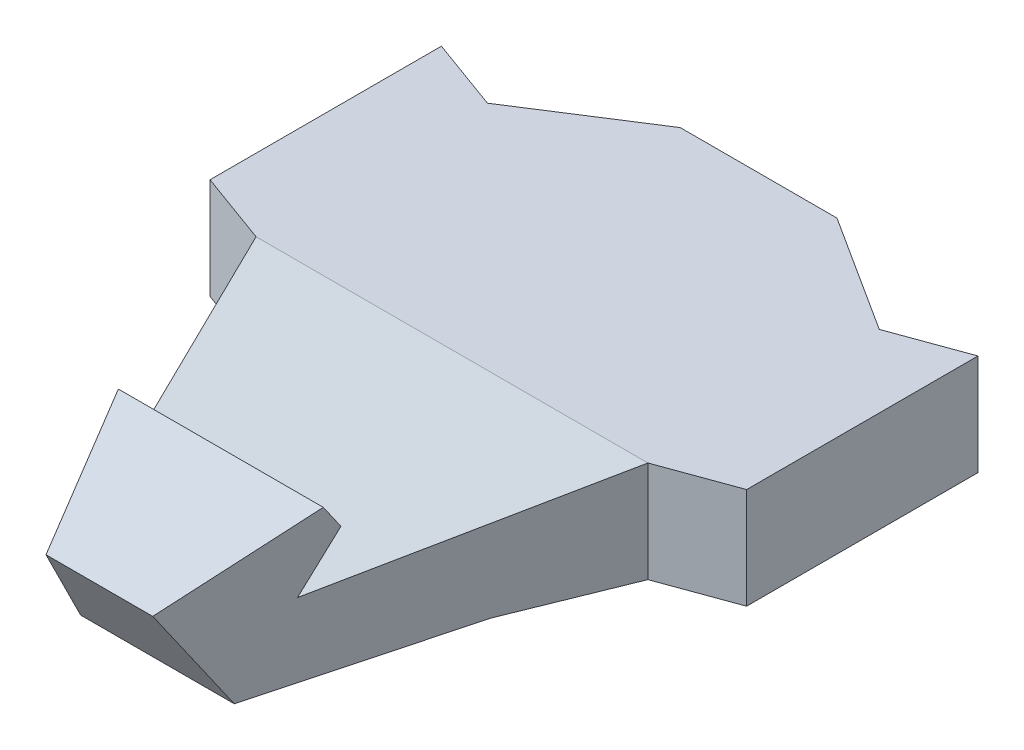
from build123d import *

# Parameters (mm, degrees)
BOSS_EXTRU_1_DEPTH           = 350
ENL_V_MAT_EXTRU_2_DEPTH      = 656.667598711
ENL_V_MAT_EXTRU_2_DEPTH_BACK = 350
ESQUISSE2_W                  = 784.427743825
ESQUISSE2_H                  = 526.453738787


with BuildPart() as part:
    # Esquisse1 → Boss.-Extru.1 (new body)
    with BuildSketch(Plane(origin=(0, 0, 0), x_dir=(1, 0, 0), z_dir=(0, 1, 0))):
        Polygon((226.103190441, 430), (123.896809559, 430), (47.210181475, 380.911501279), (0, 398.09460209), (0, 247.183100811), (47.210181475, 230), (140.193619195, 0), (209.806380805, 0), (302.789818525, 230), (350, 247.183100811), (350, 398.09460209), (302.789818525, 380.911501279), align=None)
    extrude(amount=BOSS_EXTRU_1_DEPTH)

    # Esquisse2 → Enl_v. mat.-Extru.2 (cut, two sides: drawn at the far end of the back side and taken through both)
    with BuildSketch(Plane(origin=(0, 0, 0), x_dir=(0, 0, -1), z_dir=(1, 0, 0)).offset(-ENL_V_MAT_EXTRU_2_DEPTH_BACK)):
        with Locations((249.397567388, 164.460448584)):
            Rectangle(ESQUISSE2_W, ESQUISSE2_H)
        Polygon((37.891584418, 0), (0, 60.70391631), (79.216518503, 98.684774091), (87.420569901, 85.541537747), (67.242094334, 51.299276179), (230, 78.834698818), (430, 78.834698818), (430, 12.933139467), (230, 12.933139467), (157.44106444, 12.933139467), align=None, mode=Mode.SUBTRACT)
    extrude(amount=ENL_V_MAT_EXTRU_2_DEPTH + ENL_V_MAT_EXTRU_2_DEPTH_BACK, mode=Mode.SUBTRACT)


solid = part.part
